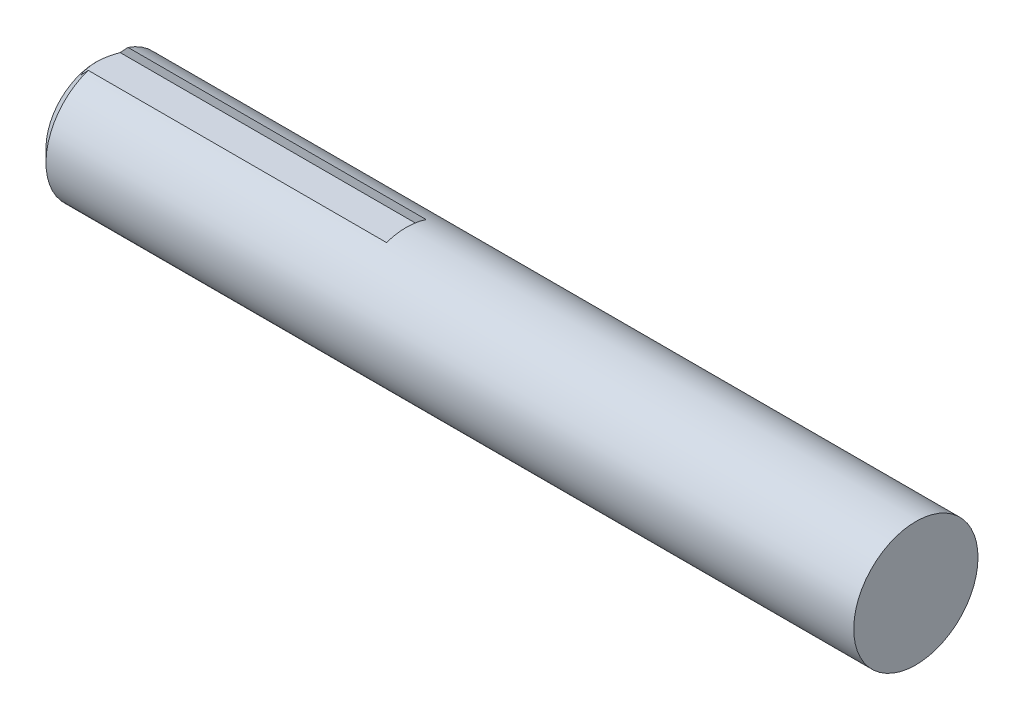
from build123d import *

# Parameters (mm, degrees)
SKETCH2_R           = 25
BOSS_EXTRUDE1_DEPTH = 330
CHAMFER1_SIZE       = 5
SKETCH3_W           = 16
SKETCH3_H           = 9
CUT_EXTRUDE1_DEPTH  = 125


with BuildPart() as part:
    # Sketch2 → Boss-Extrude1 (new body)
    with BuildSketch(Plane(origin=(0, 0, 0), x_dir=(0, 0, -1), z_dir=(1, 0, 0))):
        Circle(SKETCH2_R)
    extrude(amount=BOSS_EXTRUDE1_DEPTH)

    # Chamfer1
    chamfer1_edges = [part.edges().sort_by_distance(p)[0] for p in [
        (0, 0, 25),
    ]]
    chamfer(chamfer1_edges, length=CHAMFER1_SIZE)

    # Sketch3 → Cut-Extrude1 (cut)
    with BuildSketch(Plane.ZY):
        with Locations((0, 24.8)):
            Rectangle(SKETCH3_W, SKETCH3_H)
    extrude(amount=-CUT_EXTRUDE1_DEPTH, mode=Mode.SUBTRACT)


solid = part.part
